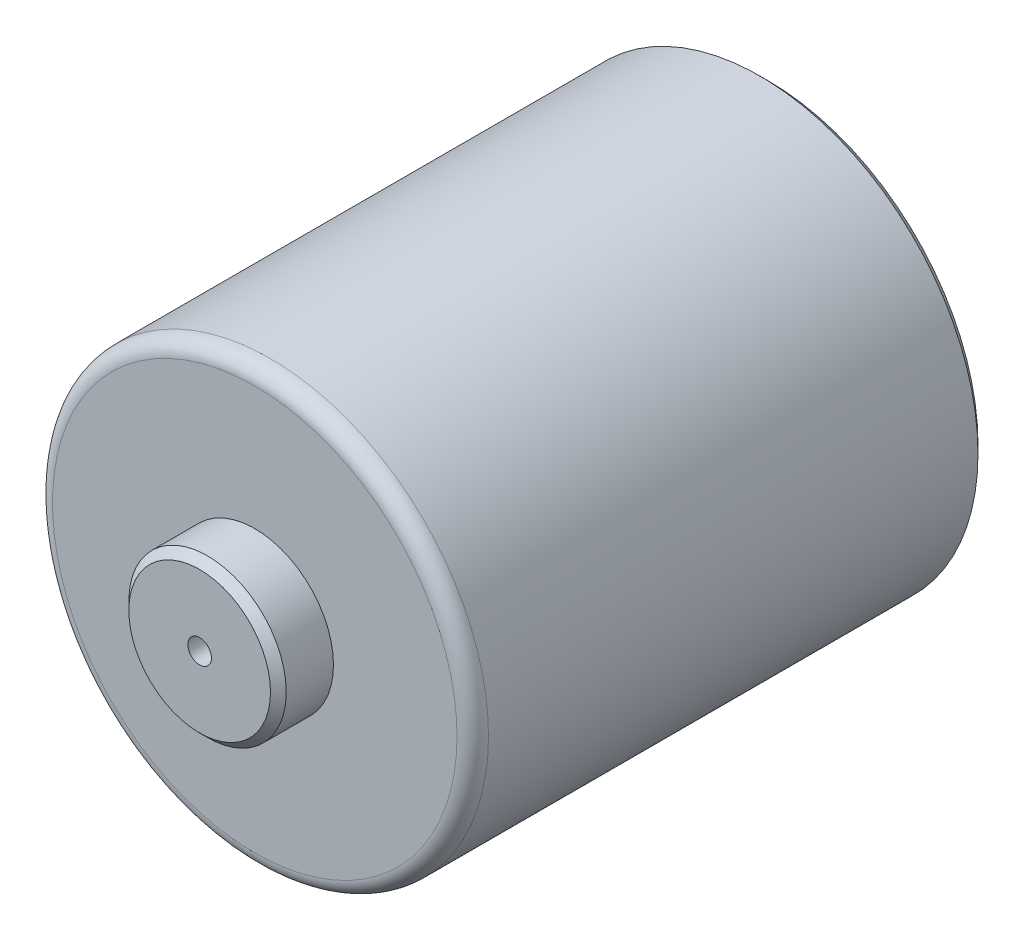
from build123d import *

# Parameters (mm, degrees)
ESQUISSE1_R             = 13.85
EXTRUSION1_DEPTH        = 32.6
ESQUISSE2_R             = 5
EXTRUSION2_DEPTH        = 3.5
EXTRUSION3_START        = 2.2
ESQUISSE3_R             = 5
EXTRUSION3_DEPTH        = 2.2
CHANFREIN1_SIZE         = 0.5
CONG_1_R                = 1
ESQUISSE4_R             = 0.75
ENL_V_MAT_EXTRU_1_DEPTH = 44.017845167


with BuildPart() as part:
    # Esquisse1 → Extrusion1 (new body)
    with BuildSketch(Plane.XY):
        Circle(ESQUISSE1_R)
    extrude(amount=EXTRUSION1_DEPTH)

    # Esquisse2 → Extrusion2 (add)
    with BuildSketch(Plane.XY.offset(32.6)):
        Circle(ESQUISSE2_R)
    extrude(amount=EXTRUSION2_DEPTH)

    # Esquisse3 → Extrusion3 (add)
    with BuildSketch(Plane(origin=(0, 0, 0), x_dir=(-1, 0, 0), z_dir=(0, 0, -1)).offset(EXTRUSION3_START)):
        with Locations(Location((0, 0, 0), (0, 0, 180))):
            Circle(ESQUISSE3_R)
    extrude(amount=-EXTRUSION3_DEPTH)

    # Chanfrein1
    chanfrein1_edges = [part.edges().sort_by_distance(p)[0] for p in [
        (-5, 0, -2.2),
        (-13.85, 0, 0),
        (-5, 0, 36.1),
    ]]
    chamfer(chanfrein1_edges, length=CHANFREIN1_SIZE)

    # Cong_1
    cong_1_edges = [part.edges().sort_by_distance(p)[0] for p in [
        (-13.85, 0, 32.6),
    ]]
    fillet(cong_1_edges, radius=CONG_1_R)

    # Esquisse4 → Enl_v. mat.-Extru.1 (cut, through all)
    with BuildSketch(Plane.XY.offset(36.1)):
        Circle(ESQUISSE4_R)
    extrude(amount=-ENL_V_MAT_EXTRU_1_DEPTH, mode=Mode.SUBTRACT)


solid = part.part
